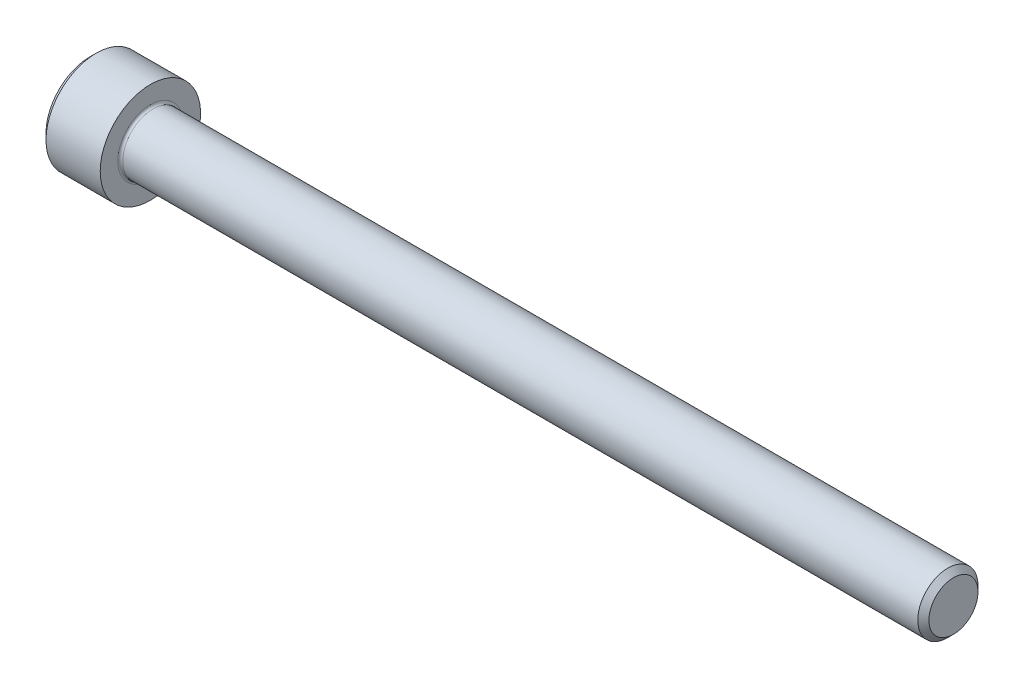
ISO-10303-21;
HEADER;
FILE_DESCRIPTION(('STEP AP214'),'2;1');
FILE_NAME('part.step','',(''),(''),'','','');
FILE_SCHEMA(('AUTOMOTIVE_DESIGN { 1 0 10303 214 1 1 1 1 }'));
ENDSEC;
DATA;
#1=APPLICATION_CONTEXT('core data for automotive mechanical design processes');
#2=APPLICATION_PROTOCOL_DEFINITION('international standard','automotive_design',2000,#1);
#3=PRODUCT_CONTEXT('',#1,'mechanical');
#4=PRODUCT('Part','Part','',(#3));
#5=PRODUCT_RELATED_PRODUCT_CATEGORY('part','',(#4));
#6=PRODUCT_DEFINITION_FORMATION('','',#4);
#7=PRODUCT_DEFINITION_CONTEXT('part definition',#1,'design');
#8=PRODUCT_DEFINITION('design','',#6,#7);
#9=PRODUCT_DEFINITION_SHAPE('','',#8);
#10=(LENGTH_UNIT() NAMED_UNIT(*) SI_UNIT(.MILLI.,.METRE.));
#11=(NAMED_UNIT(*) PLANE_ANGLE_UNIT() SI_UNIT($,.RADIAN.));
#12=(NAMED_UNIT(*) SI_UNIT($,.STERADIAN.) SOLID_ANGLE_UNIT());
#13=UNCERTAINTY_MEASURE_WITH_UNIT(LENGTH_MEASURE(1.E-05),#10,'distance_accuracy_value','');
#14=(GEOMETRIC_REPRESENTATION_CONTEXT(3) GLOBAL_UNCERTAINTY_ASSIGNED_CONTEXT((#13)) GLOBAL_UNIT_ASSIGNED_CONTEXT((#10,
#11,#12)) REPRESENTATION_CONTEXT('',''));
#15=CARTESIAN_POINT('',(0.,0.,0.));
#16=DIRECTION('',(0.,0.,1.));
#17=DIRECTION('',(1.,0.,0.));
#18=AXIS2_PLACEMENT_3D('',#15,#16,#17);
#19=CARTESIAN_POINT('',(3.,2.93524876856,0.));
#20=DIRECTION('',(1.,0.,0.));
#21=DIRECTION('',(0.,0.,-1.));
#22=AXIS2_PLACEMENT_3D('',#19,#20,#21);
#23=PLANE('',#22);
#24=DIRECTION('',(0.,1.,0.));
#25=VECTOR('',#24,1.);
#26=CARTESIAN_POINT('',(3.,2.93524876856,2.54199999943));
#27=LINE('',#26,#25);
#28=CARTESIAN_POINT('',(3.00000000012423,3.01483215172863E-10,2.541999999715));
#29=VERTEX_POINT('',#28);
#30=CARTESIAN_POINT('',(3.,-1.46762438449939,2.54199999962));
#31=VERTEX_POINT('',#30);
#32=EDGE_CURVE('E95',#29,#31,#27,.F.);
#33=ORIENTED_EDGE('',*,*,#32,.F.);
#34=CARTESIAN_POINT('',(3.00000000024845,0.,0.));
#35=DIRECTION('',(-1.,0.,0.));
#36=DIRECTION('',(0.,0.,1.));
#37=AXIS2_PLACEMENT_3D('',#34,#35,#36);
#38=CIRCLE('',#37,2.54199999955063);
#39=CARTESIAN_POINT('',(3.00000000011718,-2.20143657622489,1.27099999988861));
#40=VERTEX_POINT('',#39);
#41=EDGE_CURVE('E97',#29,#40,#38,.F.);
#42=ORIENTED_EDGE('',*,*,#41,.T.);
#43=DIRECTION('',(0.,-0.499999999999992,-0.866025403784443));
#44=VECTOR('',#43,1.);
#45=CARTESIAN_POINT('',(3.,-1.46762438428,2.542));
#46=LINE('',#45,#44);
#47=EDGE_CURVE('E100',#31,#40,#46,.T.);
#48=ORIENTED_EDGE('',*,*,#47,.F.);
#49=EDGE_LOOP('',(#33,#42,#48));
#50=FACE_BOUND('',#49,.T.);
#51=ADVANCED_FACE('F17',(#50),#23,.F.);
#52=CARTESIAN_POINT('',(3.,2.93524876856,0.));
#53=DIRECTION('',(1.,0.,0.));
#54=DIRECTION('',(0.,0.,-1.));
#55=AXIS2_PLACEMENT_3D('',#52,#53,#54);
#56=PLANE('',#55);
#57=DIRECTION('',(0.,-0.500000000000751,-0.866025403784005));
#58=VECTOR('',#57,1.);
#59=CARTESIAN_POINT('',(3.,-2.20143657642,1.271));
#60=LINE('',#59,#58);
#61=CARTESIAN_POINT('',(3.,-2.93524876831,2.61520469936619E-10));
#62=VERTEX_POINT('',#61);
#63=EDGE_CURVE('E168',#40,#62,#60,.T.);
#64=ORIENTED_EDGE('',*,*,#63,.F.);
#65=CARTESIAN_POINT('',(2.9999999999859,0.,0.));
#66=DIRECTION('',(-1.,0.,0.));
#67=DIRECTION('',(0.,0.,1.));
#68=AXIS2_PLACEMENT_3D('',#65,#66,#67);
#69=CIRCLE('',#68,2.54200000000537);
#70=CARTESIAN_POINT('',(2.9999999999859,-2.20143657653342,-1.27099999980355));
#71=VERTEX_POINT('',#70);
#72=EDGE_CURVE('E115',#40,#71,#69,.F.);
#73=ORIENTED_EDGE('',*,*,#72,.T.);
#74=DIRECTION('',(0.,0.499999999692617,-0.866025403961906));
#75=VECTOR('',#74,1.);
#76=CARTESIAN_POINT('',(3.,-2.93524876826,5.22184517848E-10));
#77=LINE('',#76,#75);
#78=EDGE_CURVE('E164',#62,#71,#77,.T.);
#79=ORIENTED_EDGE('',*,*,#78,.F.);
#80=EDGE_LOOP('',(#64,#73,#79));
#81=FACE_BOUND('',#80,.T.);
#82=ADVANCED_FACE('F223',(#81),#56,.F.);
#83=CARTESIAN_POINT('',(3.,2.93524876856,0.));
#84=DIRECTION('',(1.,0.,0.));
#85=DIRECTION('',(0.,0.,-1.));
#86=AXIS2_PLACEMENT_3D('',#83,#84,#85);
#87=PLANE('',#86);
#88=DIRECTION('',(0.,0.500000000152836,-0.866025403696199));
#89=VECTOR('',#88,1.);
#90=CARTESIAN_POINT('',(3.,-2.20143657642,-1.271));
#91=LINE('',#90,#89);
#92=CARTESIAN_POINT('',(3.,-1.46762438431,-2.54199999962));
#93=VERTEX_POINT('',#92);
#94=EDGE_CURVE('E160',#71,#93,#91,.T.);
#95=ORIENTED_EDGE('',*,*,#94,.F.);
#96=CARTESIAN_POINT('',(2.9999999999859,0.,0.));
#97=DIRECTION('',(-1.,0.,0.));
#98=DIRECTION('',(0.,0.,1.));
#99=AXIS2_PLACEMENT_3D('',#96,#97,#98);
#100=CIRCLE('',#99,2.54200000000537);
#101=CARTESIAN_POINT('',(2.9999999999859,0.,-2.54199999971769));
#102=VERTEX_POINT('',#101);
#103=EDGE_CURVE('E217',#71,#102,#100,.F.);
#104=ORIENTED_EDGE('',*,*,#103,.T.);
#105=DIRECTION('',(0.,1.,0.));
#106=VECTOR('',#105,1.);
#107=CARTESIAN_POINT('',(3.,2.93524876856,-2.54199999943));
#108=LINE('',#107,#106);
#109=EDGE_CURVE('E156',#93,#102,#108,.T.);
#110=ORIENTED_EDGE('',*,*,#109,.F.);
#111=EDGE_LOOP('',(#95,#104,#110));
#112=FACE_BOUND('',#111,.T.);
#113=ADVANCED_FACE('F226',(#112),#87,.F.);
#114=CARTESIAN_POINT('',(3.,2.93524876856,0.));
#115=DIRECTION('',(1.,0.,0.));
#116=DIRECTION('',(0.,0.,-1.));
#117=AXIS2_PLACEMENT_3D('',#114,#115,#116);
#118=PLANE('',#117);
#119=DIRECTION('',(0.,1.,0.));
#120=VECTOR('',#119,1.);
#121=CARTESIAN_POINT('',(3.,2.93524876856,-2.542));
#122=LINE('',#121,#120);
#123=CARTESIAN_POINT('',(3.,1.46762438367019,-2.54199999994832));
#124=VERTEX_POINT('',#123);
#125=EDGE_CURVE('E152',#102,#124,#122,.T.);
#126=ORIENTED_EDGE('',*,*,#125,.F.);
#127=CARTESIAN_POINT('',(2.9999999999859,0.,0.));
#128=DIRECTION('',(-1.,0.,0.));
#129=DIRECTION('',(0.,0.,1.));
#130=AXIS2_PLACEMENT_3D('',#127,#128,#129);
#131=CIRCLE('',#130,2.54200000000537);
#132=CARTESIAN_POINT('',(2.99999999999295,2.20143657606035,-1.27100000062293));
#133=VERTEX_POINT('',#132);
#134=EDGE_CURVE('E214',#102,#133,#131,.F.);
#135=ORIENTED_EDGE('',*,*,#134,.T.);
#136=DIRECTION('',(0.,0.500000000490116,0.86602540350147));
#137=VECTOR('',#136,1.);
#138=CARTESIAN_POINT('',(3.,1.46762438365,-2.54199999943));
#139=LINE('',#138,#137);
#140=EDGE_CURVE('E148',#124,#133,#139,.T.);
#141=ORIENTED_EDGE('',*,*,#140,.F.);
#142=EDGE_LOOP('',(#126,#135,#141));
#143=FACE_BOUND('',#142,.T.);
#144=ADVANCED_FACE('F234',(#143),#118,.F.);
#145=CARTESIAN_POINT('',(3.,2.93524876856,0.));
#146=DIRECTION('',(1.,0.,0.));
#147=DIRECTION('',(0.,0.,-1.));
#148=AXIS2_PLACEMENT_3D('',#145,#146,#147);
#149=PLANE('',#148);
#150=DIRECTION('',(0.,0.499999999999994,0.866025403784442));
#151=VECTOR('',#150,1.);
#152=CARTESIAN_POINT('',(3.,2.20143657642,-1.271));
#153=LINE('',#152,#151);
#154=CARTESIAN_POINT('',(3.,2.93524876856,0.));
#155=VERTEX_POINT('',#154);
#156=EDGE_CURVE('E144',#133,#155,#153,.T.);
#157=ORIENTED_EDGE('',*,*,#156,.F.);
#158=CARTESIAN_POINT('',(2.9999999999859,0.,0.));
#159=DIRECTION('',(-1.,0.,0.));
#160=DIRECTION('',(0.,0.,1.));
#161=AXIS2_PLACEMENT_3D('',#158,#159,#160);
#162=CIRCLE('',#161,2.54200000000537);
#163=CARTESIAN_POINT('',(2.99999999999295,2.20143657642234,1.27100000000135));
#164=VERTEX_POINT('',#163);
#165=EDGE_CURVE('E123',#133,#164,#162,.F.);
#166=ORIENTED_EDGE('',*,*,#165,.T.);
#167=DIRECTION('',(0.,-0.499999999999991,0.866025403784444));
#168=VECTOR('',#167,1.);
#169=CARTESIAN_POINT('',(3.,2.93524876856,0.));
#170=LINE('',#169,#168);
#171=EDGE_CURVE('E116',#155,#164,#170,.T.);
#172=ORIENTED_EDGE('',*,*,#171,.F.);
#173=EDGE_LOOP('',(#157,#166,#172));
#174=FACE_BOUND('',#173,.T.);
#175=ADVANCED_FACE('F237',(#174),#149,.F.);
#176=CARTESIAN_POINT('',(2.9999999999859,0.,0.));
#177=DIRECTION('',(-1.,0.,0.));
#178=DIRECTION('',(0.,0.,1.));
#179=AXIS2_PLACEMENT_3D('',#176,#177,#178);
#180=CONICAL_SURFACE('',#179,2.54200000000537,1.0471975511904);
#181=CARTESIAN_POINT('',(4.46762438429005,0.,0.));
#182=VERTEX_POINT('',#181);
#183=VERTEX_LOOP('',#182);
#184=FACE_BOUND('',#183,.T.);
#185=ORIENTED_EDGE('',*,*,#41,.F.);
#186=CARTESIAN_POINT('',(2.9999999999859,0.,0.));
#187=DIRECTION('',(-1.,0.,0.));
#188=DIRECTION('',(0.,0.,1.));
#189=AXIS2_PLACEMENT_3D('',#186,#187,#188);
#190=CIRCLE('',#189,2.54200000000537);
#191=EDGE_CURVE('E111',#29,#164,#190,.T.);
#192=ORIENTED_EDGE('',*,*,#191,.T.);
#193=ORIENTED_EDGE('',*,*,#165,.F.);
#194=ORIENTED_EDGE('',*,*,#134,.F.);
#195=ORIENTED_EDGE('',*,*,#103,.F.);
#196=ORIENTED_EDGE('',*,*,#72,.F.);
#197=EDGE_LOOP('',(#185,#192,#193,#194,#195,#196));
#198=FACE_BOUND('',#197,.T.);
#199=ADVANCED_FACE('F109',(#184,#198),#180,.F.);
#200=CARTESIAN_POINT('',(3.,2.93524876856,0.));
#201=DIRECTION('',(1.,0.,0.));
#202=DIRECTION('',(0.,0.,-1.));
#203=AXIS2_PLACEMENT_3D('',#200,#201,#202);
#204=PLANE('',#203);
#205=DIRECTION('',(0.,0.50000000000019,-0.866025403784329));
#206=VECTOR('',#205,1.);
#207=CARTESIAN_POINT('',(3.,2.93524876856,0.));
#208=LINE('',#207,#206);
#209=CARTESIAN_POINT('',(3.,1.46762438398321,2.54199999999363));
#210=VERTEX_POINT('',#209);
#211=EDGE_CURVE('E122',#164,#210,#208,.F.);
#212=ORIENTED_EDGE('',*,*,#211,.F.);
#213=ORIENTED_EDGE('',*,*,#191,.F.);
#214=DIRECTION('',(0.,-1.,0.));
#215=VECTOR('',#214,1.);
#216=CARTESIAN_POINT('',(3.,-1.46762438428,2.542));
#217=LINE('',#216,#215);
#218=EDGE_CURVE('E120',#29,#210,#217,.F.);
#219=ORIENTED_EDGE('',*,*,#218,.T.);
#220=EDGE_LOOP('',(#212,#213,#219));
#221=FACE_BOUND('',#220,.T.);
#222=ADVANCED_FACE('F119',(#221),#204,.F.);
#223=CARTESIAN_POINT('',(3.,2.93524876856,0.));
#224=DIRECTION('',(0.,-0.866025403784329,-0.50000000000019));
#225=DIRECTION('',(0.,0.50000000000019,-0.866025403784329));
#226=AXIS2_PLACEMENT_3D('',#223,#224,#225);
#227=PLANE('',#226);
#228=ORIENTED_EDGE('',*,*,#211,.T.);
#229=DIRECTION('',(1.,0.,0.));
#230=VECTOR('',#229,1.);
#231=CARTESIAN_POINT('',(3.,1.46762438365,2.542));
#232=LINE('',#231,#230);
#233=CARTESIAN_POINT('',(0.,1.46762438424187,2.54199999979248));
#234=VERTEX_POINT('',#233);
#235=EDGE_CURVE('E128',#210,#234,#232,.F.);
#236=ORIENTED_EDGE('',*,*,#235,.T.);
#237=DIRECTION('',(0.,-0.500000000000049,0.866025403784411));
#238=VECTOR('',#237,1.);
#239=CARTESIAN_POINT('',(0.,2.93524876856,0.));
#240=LINE('',#239,#238);
#241=CARTESIAN_POINT('',(0.,2.93524876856,0.));
#242=VERTEX_POINT('',#241);
#243=EDGE_CURVE('E135',#242,#234,#240,.T.);
#244=ORIENTED_EDGE('',*,*,#243,.F.);
#245=DIRECTION('',(1.,0.,0.));
#246=VECTOR('',#245,1.);
#247=CARTESIAN_POINT('',(3.,2.93524876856,0.));
#248=LINE('',#247,#246);
#249=EDGE_CURVE('E179',#242,#155,#248,.T.);
#250=ORIENTED_EDGE('',*,*,#249,.T.);
#251=ORIENTED_EDGE('',*,*,#171,.T.);
#252=EDGE_LOOP('',(#228,#236,#244,#250,#251));
#253=FACE_BOUND('',#252,.T.);
#254=ADVANCED_FACE('F245',(#253),#227,.T.);
#255=CARTESIAN_POINT('',(3.,-1.46762438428,2.542));
#256=DIRECTION('',(0.,0.,1.));
#257=DIRECTION('',(0.,-1.,0.));
#258=AXIS2_PLACEMENT_3D('',#255,#256,#257);
#259=PLANE('',#258);
#260=ORIENTED_EDGE('',*,*,#235,.F.);
#261=ORIENTED_EDGE('',*,*,#218,.F.);
#262=ORIENTED_EDGE('',*,*,#32,.T.);
#263=DIRECTION('',(1.,0.,0.));
#264=VECTOR('',#263,1.);
#265=CARTESIAN_POINT('',(3.,-1.46762438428,2.542));
#266=LINE('',#265,#264);
#267=CARTESIAN_POINT('',(0.,-1.46762438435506,2.54199999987));
#268=VERTEX_POINT('',#267);
#269=EDGE_CURVE('E130',#268,#31,#266,.T.);
#270=ORIENTED_EDGE('',*,*,#269,.F.);
#271=DIRECTION('',(0.,1.,0.));
#272=VECTOR('',#271,1.);
#273=CARTESIAN_POINT('',(0.,0.,2.54199999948));
#274=LINE('',#273,#272);
#275=EDGE_CURVE('E249',#234,#268,#274,.F.);
#276=ORIENTED_EDGE('',*,*,#275,.F.);
#277=EDGE_LOOP('',(#260,#261,#262,#270,#276));
#278=FACE_BOUND('',#277,.T.);
#279=ADVANCED_FACE('F126',(#278),#259,.F.);
#280=CARTESIAN_POINT('',(3.,-1.46762438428,2.542));
#281=DIRECTION('',(0.,0.866025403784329,-0.50000000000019));
#282=DIRECTION('',(0.,0.50000000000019,0.866025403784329));
#283=AXIS2_PLACEMENT_3D('',#280,#281,#282);
#284=PLANE('',#283);
#285=ORIENTED_EDGE('',*,*,#63,.T.);
#286=DIRECTION('',(1.,0.,0.));
#287=VECTOR('',#286,1.);
#288=CARTESIAN_POINT('',(3.,-2.93524876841,-2.59807231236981E-10));
#289=LINE('',#288,#287);
#290=CARTESIAN_POINT('',(0.,-2.93524876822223,1.95986455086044E-10));
#291=VERTEX_POINT('',#290);
#292=EDGE_CURVE('E190',#291,#62,#289,.T.);
#293=ORIENTED_EDGE('',*,*,#292,.F.);
#294=DIRECTION('',(0.,-0.499999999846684,-0.866025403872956));
#295=VECTOR('',#294,1.);
#296=CARTESIAN_POINT('',(0.,-1.46762438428,2.542));
#297=LINE('',#296,#295);
#298=EDGE_CURVE('E250',#268,#291,#297,.T.);
#299=ORIENTED_EDGE('',*,*,#298,.F.);
#300=ORIENTED_EDGE('',*,*,#269,.T.);
#301=ORIENTED_EDGE('',*,*,#47,.T.);
#302=EDGE_LOOP('',(#285,#293,#299,#300,#301));
#303=FACE_BOUND('',#302,.T.);
#304=ADVANCED_FACE('F333',(#303),#284,.T.);
#305=CARTESIAN_POINT('',(3.,-2.93524876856,0.));
#306=DIRECTION('',(0.,0.866025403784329,0.50000000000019));
#307=DIRECTION('',(0.,-0.50000000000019,0.866025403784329));
#308=AXIS2_PLACEMENT_3D('',#305,#306,#307);
#309=PLANE('',#308);
#310=ORIENTED_EDGE('',*,*,#94,.T.);
#311=DIRECTION('',(1.,0.,0.));
#312=VECTOR('',#311,1.);
#313=CARTESIAN_POINT('',(3.,-1.46762438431,-2.542));
#314=LINE('',#313,#312);
#315=CARTESIAN_POINT('',(0.,-1.46762438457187,-2.54199999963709));
#316=VERTEX_POINT('',#315);
#317=EDGE_CURVE('E183',#93,#316,#314,.F.);
#318=ORIENTED_EDGE('',*,*,#317,.T.);
#319=DIRECTION('',(0.,0.499999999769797,-0.866025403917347));
#320=VECTOR('',#319,1.);
#321=CARTESIAN_POINT('',(0.,-2.93524876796,0.));
#322=LINE('',#321,#320);
#323=EDGE_CURVE('E252',#291,#316,#322,.T.);
#324=ORIENTED_EDGE('',*,*,#323,.F.);
#325=ORIENTED_EDGE('',*,*,#292,.T.);
#326=ORIENTED_EDGE('',*,*,#78,.T.);
#327=EDGE_LOOP('',(#310,#318,#324,#325,#326));
#328=FACE_BOUND('',#327,.T.);
#329=ADVANCED_FACE('F329',(#328),#309,.T.);
#330=CARTESIAN_POINT('',(3.,1.46762438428,-2.542));
#331=DIRECTION('',(0.,0.,-1.));
#332=DIRECTION('',(0.,1.,0.));
#333=AXIS2_PLACEMENT_3D('',#330,#331,#332);
#334=PLANE('',#333);
#335=ORIENTED_EDGE('',*,*,#317,.F.);
#336=ORIENTED_EDGE('',*,*,#109,.T.);
#337=ORIENTED_EDGE('',*,*,#125,.T.);
#338=DIRECTION('',(1.,0.,0.));
#339=VECTOR('',#338,1.);
#340=CARTESIAN_POINT('',(3.,1.46762438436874,-2.54199999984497));
#341=LINE('',#340,#339);
#342=CARTESIAN_POINT('',(0.,1.46762438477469,-2.54199999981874));
#343=VERTEX_POINT('',#342);
#344=EDGE_CURVE('E182',#124,#343,#341,.F.);
#345=ORIENTED_EDGE('',*,*,#344,.T.);
#346=DIRECTION('',(0.,1.,0.));
#347=VECTOR('',#346,1.);
#348=CARTESIAN_POINT('',(0.,0.,-2.54199999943));
#349=LINE('',#348,#347);
#350=EDGE_CURVE('E257',#316,#343,#349,.T.);
#351=ORIENTED_EDGE('',*,*,#350,.F.);
#352=EDGE_LOOP('',(#335,#336,#337,#345,#351));
#353=FACE_BOUND('',#352,.T.);
#354=ADVANCED_FACE('F326',(#353),#334,.F.);
#355=CARTESIAN_POINT('',(3.,2.93524876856,0.));
#356=DIRECTION('',(0.,0.866025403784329,-0.50000000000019));
#357=DIRECTION('',(0.,0.50000000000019,0.866025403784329));
#358=AXIS2_PLACEMENT_3D('',#355,#356,#357);
#359=PLANE('',#358);
#360=ORIENTED_EDGE('',*,*,#344,.F.);
#361=ORIENTED_EDGE('',*,*,#140,.T.);
#362=ORIENTED_EDGE('',*,*,#156,.T.);
#363=ORIENTED_EDGE('',*,*,#249,.F.);
#364=DIRECTION('',(0.,0.499999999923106,0.866025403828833));
#365=VECTOR('',#364,1.);
#366=CARTESIAN_POINT('',(0.,1.46762438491,-2.54199999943));
#367=LINE('',#366,#365);
#368=EDGE_CURVE('E210',#343,#242,#367,.T.);
#369=ORIENTED_EDGE('',*,*,#368,.F.);
#370=EDGE_LOOP('',(#360,#361,#362,#363,#369));
#371=FACE_BOUND('',#370,.T.);
#372=ADVANCED_FACE('F241',(#371),#359,.F.);
#373=CARTESIAN_POINT('',(0.,0.,0.));
#374=DIRECTION('',(-1.,0.,0.));
#375=DIRECTION('',(0.,0.,1.));
#376=AXIS2_PLACEMENT_3D('',#373,#374,#375);
#377=PLANE('',#376);
#378=ORIENTED_EDGE('',*,*,#350,.T.);
#379=ORIENTED_EDGE('',*,*,#368,.T.);
#380=ORIENTED_EDGE('',*,*,#243,.T.);
#381=ORIENTED_EDGE('',*,*,#275,.T.);
#382=ORIENTED_EDGE('',*,*,#298,.T.);
#383=ORIENTED_EDGE('',*,*,#323,.T.);
#384=EDGE_LOOP('',(#378,#379,#380,#381,#382,#383));
#385=FACE_BOUND('',#384,.T.);
#386=CARTESIAN_POINT('',(0.,0.,0.));
#387=DIRECTION('',(1.,0.,0.));
#388=DIRECTION('',(0.,0.,-1.));
#389=AXIS2_PLACEMENT_3D('',#386,#387,#388);
#390=CIRCLE('',#389,4.39999999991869);
#391=CARTESIAN_POINT('',(0.,0.,-4.39999999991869));
#392=VERTEX_POINT('',#391);
#393=EDGE_CURVE('E208',#392,#392,#390,.T.);
#394=ORIENTED_EDGE('',*,*,#393,.F.);
#395=EDGE_LOOP('',(#394));
#396=FACE_BOUND('',#395,.T.);
#397=ADVANCED_FACE('F320',(#385,#396),#377,.T.);
#398=CARTESIAN_POINT('',(0.600000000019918,0.,0.));
#399=DIRECTION('',(1.,0.,0.));
#400=DIRECTION('',(0.,0.,-1.));
#401=AXIS2_PLACEMENT_3D('',#398,#399,#400);
#402=CONICAL_SURFACE('',#401,4.99999999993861,0.785398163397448);
#403=ORIENTED_EDGE('',*,*,#393,.T.);
#404=EDGE_LOOP('',(#403));
#405=FACE_BOUND('',#404,.T.);
#406=CARTESIAN_POINT('',(0.600000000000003,0.,0.));
#407=DIRECTION('',(-1.,0.,0.));
#408=DIRECTION('',(0.,0.,1.));
#409=AXIS2_PLACEMENT_3D('',#406,#407,#408);
#410=CIRCLE('',#409,5.);
#411=CARTESIAN_POINT('',(0.600000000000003,0.,5.));
#412=VERTEX_POINT('',#411);
#413=EDGE_CURVE('E207',#412,#412,#410,.F.);
#414=ORIENTED_EDGE('',*,*,#413,.F.);
#415=EDGE_LOOP('',(#414));
#416=FACE_BOUND('',#415,.T.);
#417=ADVANCED_FACE('F316',(#405,#416),#402,.T.);
#418=CARTESIAN_POINT('',(-31.75,0.,0.));
#419=DIRECTION('',(-1.,0.,0.));
#420=DIRECTION('',(0.,0.,1.));
#421=AXIS2_PLACEMENT_3D('',#418,#419,#420);
#422=CYLINDRICAL_SURFACE('',#421,5.);
#423=CARTESIAN_POINT('',(6.,0.,0.));
#424=DIRECTION('',(-1.,0.,0.));
#425=DIRECTION('',(0.,0.,1.));
#426=AXIS2_PLACEMENT_3D('',#423,#424,#425);
#427=CIRCLE('',#426,5.);
#428=CARTESIAN_POINT('',(6.,0.,5.));
#429=VERTEX_POINT('',#428);
#430=EDGE_CURVE('E204',#429,#429,#427,.F.);
#431=ORIENTED_EDGE('',*,*,#430,.F.);
#432=EDGE_LOOP('',(#431));
#433=FACE_BOUND('',#432,.T.);
#434=ORIENTED_EDGE('',*,*,#413,.T.);
#435=EDGE_LOOP('',(#434));
#436=FACE_BOUND('',#435,.T.);
#437=ADVANCED_FACE('F312',(#433,#436),#422,.T.);
#438=CARTESIAN_POINT('',(86.,2.4455,0.));
#439=DIRECTION('',(1.,0.,0.));
#440=DIRECTION('',(0.,0.,-1.));
#441=AXIS2_PLACEMENT_3D('',#438,#439,#440);
#442=PLANE('',#441);
#443=CARTESIAN_POINT('',(86.0000000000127,0.,0.));
#444=DIRECTION('',(-1.,0.,0.));
#445=DIRECTION('',(0.,0.,1.));
#446=AXIS2_PLACEMENT_3D('',#443,#444,#445);
#447=CIRCLE('',#446,2.4454999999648);
#448=CARTESIAN_POINT('',(86.0000000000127,0.,2.4454999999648));
#449=VERTEX_POINT('',#448);
#450=EDGE_CURVE('E200',#449,#449,#447,.T.);
#451=ORIENTED_EDGE('',*,*,#450,.F.);
#452=EDGE_LOOP('',(#451));
#453=FACE_BOUND('',#452,.T.);
#454=ADVANCED_FACE('F301',(#453),#442,.T.);
#455=CARTESIAN_POINT('',(6.,5.,0.));
#456=DIRECTION('',(1.,0.,0.));
#457=DIRECTION('',(0.,0.,-1.));
#458=AXIS2_PLACEMENT_3D('',#455,#456,#457);
#459=PLANE('',#458);
#460=CARTESIAN_POINT('',(6.,0.,0.));
#461=DIRECTION('',(1.,0.,0.));
#462=DIRECTION('',(0.,0.,1.));
#463=AXIS2_PLACEMENT_3D('',#460,#461,#462);
#464=CIRCLE('',#463,3.25);
#465=CARTESIAN_POINT('',(6.,0.,-3.25));
#466=VERTEX_POINT('',#465);
#467=CARTESIAN_POINT('',(6.,0.,3.25));
#468=VERTEX_POINT('',#467);
#469=EDGE_CURVE('E203',#466,#468,#464,.F.);
#470=ORIENTED_EDGE('',*,*,#469,.T.);
#471=CARTESIAN_POINT('',(6.,0.,-3.25));
#472=CARTESIAN_POINT('',(6.00000000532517,0.0425763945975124,-3.24998718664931));
#473=CARTESIAN_POINT('',(6.00000000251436,0.0851521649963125,-3.24914609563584));
#474=CARTESIAN_POINT('',(5.99999999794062,0.17023607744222,-3.24581345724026));
#475=CARTESIAN_POINT('',(5.99999999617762,0.212744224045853,-3.24332202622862));
#476=CARTESIAN_POINT('',(6.00000001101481,0.297630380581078,-3.23669497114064));
#477=CARTESIAN_POINT('',(6.00000002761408,0.340008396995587,-3.23255943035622));
#478=CARTESIAN_POINT('',(6.00000007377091,0.424568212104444,-3.22263708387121));
#479=CARTESIAN_POINT('',(6.00000010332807,0.466750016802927,-3.21685032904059));
#480=CARTESIAN_POINT('',(6.0000003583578,0.550866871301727,-3.2036862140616));
#481=CARTESIAN_POINT('',(6.00000058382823,0.592801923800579,-3.19630887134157));
#482=CARTESIAN_POINT('',(6.00000074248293,0.660206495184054,-3.18296934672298));
#483=CARTESIAN_POINT('',(6.00000075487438,0.685786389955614,-3.17755934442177));
#484=CARTESIAN_POINT('',(6.00000070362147,0.757853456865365,-3.16137245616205));
#485=CARTESIAN_POINT('',(6.00000056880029,0.804175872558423,-3.14985056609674));
#486=CARTESIAN_POINT('',(6.00000037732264,0.881045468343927,-3.12891688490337));
#487=CARTESIAN_POINT('',(6.00000030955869,0.911747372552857,-3.12006594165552));
#488=CARTESIAN_POINT('',(6.00000019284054,0.971970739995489,-3.10173621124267));
#489=CARTESIAN_POINT('',(6.00000014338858,1.0015002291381,-3.09228379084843));
#490=CARTESIAN_POINT('',(6.00000004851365,1.07595008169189,-3.06727588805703));
#491=CARTESIAN_POINT('',(6.00000001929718,1.12068186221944,-3.05115352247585));
#492=CARTESIAN_POINT('',(6.00000000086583,1.19139695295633,-3.02392060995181));
#493=CARTESIAN_POINT('',(6.00000000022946,1.21762221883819,-3.01343120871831));
#494=CARTESIAN_POINT('',(5.99999999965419,1.28303073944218,-2.98630750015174));
#495=CARTESIAN_POINT('',(6.00000000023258,1.32204164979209,-2.96925430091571));
#496=CARTESIAN_POINT('',(5.99999999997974,1.39936413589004,-2.93363820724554));
#497=CARTESIAN_POINT('',(5.9999999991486,1.43767575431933,-2.91507540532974));
#498=CARTESIAN_POINT('',(6.00000002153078,1.51355069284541,-2.87648154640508));
#499=CARTESIAN_POINT('',(6.00000004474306,1.55111404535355,-2.85645055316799));
#500=CARTESIAN_POINT('',(6.00000010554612,1.62542686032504,-2.81493620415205));
#501=CARTESIAN_POINT('',(6.00000014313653,1.66217634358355,-2.79345288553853));
#502=CARTESIAN_POINT('',(6.00000041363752,1.73483768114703,-2.74910938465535));
#503=CARTESIAN_POINT('',(6.0000006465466,1.77074954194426,-2.72624921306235));
#504=CARTESIAN_POINT('',(6.00000080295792,1.82795861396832,-2.68810209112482));
#505=CARTESIAN_POINT('',(6.00000081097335,1.84956797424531,-2.67328132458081));
#506=CARTESIAN_POINT('',(6.00000074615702,1.90998925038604,-2.63071737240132));
#507=CARTESIAN_POINT('',(6.00000060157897,1.94836508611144,-2.60235080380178));
#508=CARTESIAN_POINT('',(6.00000039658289,2.01133484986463,-2.55361779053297));
#509=CARTESIAN_POINT('',(6.00000032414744,2.0362866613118,-2.53371064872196));
#510=CARTESIAN_POINT('',(6.00000020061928,2.08465109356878,-2.49394203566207));
#511=CARTESIAN_POINT('',(6.00000014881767,2.10808611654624,-2.47410780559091));
#512=CARTESIAN_POINT('',(6.00000004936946,2.16697759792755,-2.42282018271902));
#513=CARTESIAN_POINT('',(6.0000000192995,2.20204149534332,-2.39091337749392));
#514=CARTESIAN_POINT('',(6.0000000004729,2.25722218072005,-2.33847965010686));
#515=CARTESIAN_POINT('',(6.00000000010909,2.27778663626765,-2.31842030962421));
#516=CARTESIAN_POINT('',(5.99999999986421,2.3281776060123,-2.26798939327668));
#517=CARTESIAN_POINT('',(6.00000000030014,2.35769325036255,-2.23730550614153));
#518=CARTESIAN_POINT('',(5.99999999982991,2.4155006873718,-2.17481052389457));
#519=CARTESIAN_POINT('',(5.99999999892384,2.44379255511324,-2.14299949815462));
#520=CARTESIAN_POINT('',(6.00000002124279,2.49912306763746,-2.0783073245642));
#521=CARTESIAN_POINT('',(6.00000004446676,2.52616176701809,-2.04542622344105));
#522=CARTESIAN_POINT('',(6.00000010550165,2.57893142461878,-1.9786336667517));
#523=CARTESIAN_POINT('',(6.00000014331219,2.60466241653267,-1.94472223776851));
#524=CARTESIAN_POINT('',(6.00000041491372,2.65482362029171,-1.87594786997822));
#525=CARTESIAN_POINT('',(6.00000064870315,2.67925384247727,-1.8410849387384));
#526=CARTESIAN_POINT('',(6.00000080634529,2.71752290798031,-1.78392958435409));
#527=CARTESIAN_POINT('',(6.00000081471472,2.73182804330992,-1.76194807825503));
#528=CARTESIAN_POINT('',(6.00000075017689,2.7713680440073,-1.69948869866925));
#529=CARTESIAN_POINT('',(6.00000060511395,2.79596216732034,-1.65860224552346));
#530=CARTESIAN_POINT('',(6.00000039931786,2.83547615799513,-1.58950167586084));
#531=CARTESIAN_POINT('',(6.00000032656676,2.85090253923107,-1.56157499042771));
#532=CARTESIAN_POINT('',(6.00000020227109,2.88038482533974,-1.5062908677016));
#533=CARTESIAN_POINT('',(6.00000015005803,2.89447006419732,-1.47894907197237));
#534=CARTESIAN_POINT('',(6.00000004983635,2.92928428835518,-1.40895374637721));
#535=CARTESIAN_POINT('',(6.00000001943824,2.94947738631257,-1.36603173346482));
#536=CARTESIAN_POINT('',(6.00000000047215,2.9803631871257,-1.29652211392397));
#537=CARTESIAN_POINT('',(6.00000000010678,2.99165160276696,-1.27019651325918));
#538=CARTESIAN_POINT('',(5.99999999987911,3.01887545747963,-1.2043969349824));
#539=CARTESIAN_POINT('',(6.00000000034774,3.03440220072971,-1.16475256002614));
#540=CARTESIAN_POINT('',(5.99999999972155,3.06389369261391,-1.08489082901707));
#541=CARTESIAN_POINT('',(5.99999999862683,3.07785853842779,-1.04467350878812));
#542=CARTESIAN_POINT('',(6.0000000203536,3.10422096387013,-0.963729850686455));
#543=CARTESIAN_POINT('',(6.00000004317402,3.11661861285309,-0.923003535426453));
#544=CARTESIAN_POINT('',(6.00000010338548,3.13981148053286,-0.841099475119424));
#545=CARTESIAN_POINT('',(6.00000014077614,3.15060674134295,-0.799921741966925));
#546=CARTESIAN_POINT('',(6.00000041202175,3.17063151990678,-0.717185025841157));
#547=CARTESIAN_POINT('',(6.00000064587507,3.17986105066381,-0.675626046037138));
#548=CARTESIAN_POINT('',(6.00000080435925,3.1933442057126,-0.608180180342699));
#549=CARTESIAN_POINT('',(6.00000081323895,3.1981477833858,-0.58240213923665));
#550=CARTESIAN_POINT('',(6.00000075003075,3.21077584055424,-0.509569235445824));
#551=CARTESIAN_POINT('',(6.00000060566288,3.21785180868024,-0.462382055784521));
#552=CARTESIAN_POINT('',(6.00000040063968,3.22791536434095,-0.383415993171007));
#553=CARTESIAN_POINT('',(6.00000032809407,3.23148088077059,-0.351708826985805));
#554=CARTESIAN_POINT('',(6.00000020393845,3.2375653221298,-0.289325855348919));
#555=CARTESIAN_POINT('',(6.00000015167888,3.24011679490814,-0.258653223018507));
#556=CARTESIAN_POINT('',(6.00000005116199,3.24549564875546,-0.180630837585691));
#557=CARTESIAN_POINT('',(6.00000002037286,3.24772521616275,-0.133238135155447));
#558=CARTESIAN_POINT('',(6.0000000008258,3.24965765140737,-0.0572242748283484));
#559=CARTESIAN_POINT('',(6.00000000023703,3.25001209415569,-0.028617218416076));
#560=CARTESIAN_POINT('',(5.99999999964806,3.24998156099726,0.0424882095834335));
#561=CARTESIAN_POINT('',(6.00000000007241,3.24915403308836,0.0849876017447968));
#562=CARTESIAN_POINT('',(6.00000000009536,3.2458328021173,0.16991948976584));
#563=CARTESIAN_POINT('',(5.99999999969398,3.24333913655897,0.212351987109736));
#564=CARTESIAN_POINT('',(6.00000000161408,3.23670266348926,0.29708735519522));
#565=CARTESIAN_POINT('',(6.00000000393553,3.23255987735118,0.339390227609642));
#566=CARTESIAN_POINT('',(6.00000001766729,3.22262781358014,0.423802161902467));
#567=CARTESIAN_POINT('',(6.00000002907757,3.21683854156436,0.465911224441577));
#568=CARTESIAN_POINT('',(6.00000007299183,3.20362391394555,0.549871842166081));
#569=CARTESIAN_POINT('',(6.00000010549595,3.19619854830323,0.591723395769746));
#570=CARTESIAN_POINT('',(6.00000020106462,3.17972020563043,0.675106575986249));
#571=CARTESIAN_POINT('',(6.00000026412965,3.17066720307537,0.716638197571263));
#572=CARTESIAN_POINT('',(6.00000041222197,3.15558247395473,0.779912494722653));
#573=CARTESIAN_POINT('',(6.00000047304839,3.15012701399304,0.801794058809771));
#574=CARTESIAN_POINT('',(6.00000058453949,3.1393955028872,0.842980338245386));
#575=CARTESIAN_POINT('',(6.00000063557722,3.13416840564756,0.862297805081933));
#576=CARTESIAN_POINT('',(6.00000073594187,3.11722263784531,0.922594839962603));
#577=CARTESIAN_POINT('',(6.0000007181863,3.10484202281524,0.963390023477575));
#578=CARTESIAN_POINT('',(6.00000052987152,3.07845495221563,1.04443538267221));
#579=CARTESIAN_POINT('',(6.00000035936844,3.06444909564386,1.08468575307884));
#580=CARTESIAN_POINT('',(6.00000011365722,3.03774347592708,1.1563777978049));
#581=CARTESIAN_POINT('',(6.00000002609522,3.02536174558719,1.18793860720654));
#582=CARTESIAN_POINT('',(5.99999998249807,3.00394912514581,1.24062569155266));
#583=CARTESIAN_POINT('',(5.99999999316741,2.99512444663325,1.26183655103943));
#584=CARTESIAN_POINT('',(6.00000001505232,2.96859722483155,1.32374030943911));
#585=CARTESIAN_POINT('',(6.00000001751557,2.95028340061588,1.36417266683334));
#586=CARTESIAN_POINT('',(6.00000009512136,2.900031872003,1.46937358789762));
#587=CARTESIAN_POINT('',(6.00000021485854,2.86675076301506,1.53350843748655));
#588=CARTESIAN_POINT('',(6.0000004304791,2.81359206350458,1.62804969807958));
#589=CARTESIAN_POINT('',(6.00000050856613,2.79528928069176,1.65935341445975));
#590=CARTESIAN_POINT('',(6.00000062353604,2.75544976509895,1.72489642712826));
#591=CARTESIAN_POINT('',(6.0000006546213,2.73378362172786,1.75905741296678));
#592=CARTESIAN_POINT('',(6.00000066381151,2.68813763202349,1.82810046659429));
#593=CARTESIAN_POINT('',(6.00000063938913,2.66409706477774,1.86294235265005));
#594=CARTESIAN_POINT('',(6.00000054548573,2.61356034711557,1.93317248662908));
#595=CARTESIAN_POINT('',(6.00000047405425,2.58700257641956,1.96851642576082));
#596=CARTESIAN_POINT('',(6.00000030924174,2.53247045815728,2.03804096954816));
#597=CARTESIAN_POINT('',(6.00000021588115,2.50449744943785,2.07222262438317));
#598=CARTESIAN_POINT('',(6.00000009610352,2.45051494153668,2.13552493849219));
#599=CARTESIAN_POINT('',(6.00000006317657,2.42465415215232,2.1647726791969));
#600=CARTESIAN_POINT('',(6.00000002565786,2.37107679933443,2.22326121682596));
#601=CARTESIAN_POINT('',(6.00000002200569,2.34332733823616,2.25247189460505));
#602=CARTESIAN_POINT('',(6.00000002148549,2.28486478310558,2.31179750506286));
#603=CARTESIAN_POINT('',(6.00000002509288,2.25407817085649,2.34184002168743));
#604=CARTESIAN_POINT('',(6.00000004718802,2.18936309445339,2.40256016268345));
#605=CARTESIAN_POINT('',(6.00000006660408,2.15535915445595,2.43315742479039));
#606=CARTESIAN_POINT('',(6.0000001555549,2.08941207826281,2.49005958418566));
#607=CARTESIAN_POINT('',(6.00000022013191,2.05758179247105,2.51649551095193));
#608=CARTESIAN_POINT('',(6.00000039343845,1.98679960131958,2.5730256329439));
#609=CARTESIAN_POINT('',(6.00000050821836,1.94764180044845,2.60286295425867));
#610=CARTESIAN_POINT('',(6.00000065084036,1.87337685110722,2.65678123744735));
#611=CARTESIAN_POINT('',(6.00000068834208,1.8384382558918,2.68109490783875));
#612=CARTESIAN_POINT('',(6.00000070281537,1.76801423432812,2.72804875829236));
#613=CARTESIAN_POINT('',(6.00000068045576,1.73253921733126,2.75070454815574));
#614=CARTESIAN_POINT('',(6.00000056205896,1.65608539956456,2.79742527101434));
#615=CARTESIAN_POINT('',(6.0000004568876,1.61498704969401,2.82129484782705));
#616=CARTESIAN_POINT('',(6.00000026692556,1.53093339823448,2.86766341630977));
#617=CARTESIAN_POINT('',(6.00000018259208,1.48795733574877,2.89012473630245));
#618=CARTESIAN_POINT('',(6.000000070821,1.40051501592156,2.93338559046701));
#619=CARTESIAN_POINT('',(6.00000004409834,1.35603691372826,2.95416119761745));
#620=CARTESIAN_POINT('',(6.00000001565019,1.27356782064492,2.99045190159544));
#621=CARTESIAN_POINT('',(6.00000001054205,1.23571014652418,3.00627076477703));
#622=CARTESIAN_POINT('',(6.00000000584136,1.16691980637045,3.03352162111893));
#623=CARTESIAN_POINT('',(6.00000000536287,1.1360867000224,3.04520516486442));
#624=CARTESIAN_POINT('',(6.00000001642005,1.09412505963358,3.06041100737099));
#625=CARTESIAN_POINT('',(6.000000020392,1.08313848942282,3.06432837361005));
#626=CARTESIAN_POINT('',(6.00000003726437,1.04921840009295,3.07622035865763));
#627=CARTESIAN_POINT('',(6.00000005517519,1.02621634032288,3.08400033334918));
#628=CARTESIAN_POINT('',(6.00000010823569,0.962725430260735,3.10467547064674));
#629=CARTESIAN_POINT('',(6.00000014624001,0.922059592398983,3.11703100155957));
#630=CARTESIAN_POINT('',(6.00000021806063,0.84027208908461,3.1401276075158));
#631=CARTESIAN_POINT('',(6.00000025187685,0.799150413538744,3.15086864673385));
#632=CARTESIAN_POINT('',(6.00000030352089,0.716513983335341,3.17071740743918));
#633=CARTESIAN_POINT('',(6.00000032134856,0.674999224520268,3.17982511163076));
#634=CARTESIAN_POINT('',(6.0000003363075,0.591642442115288,3.19639336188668));
#635=CARTESIAN_POINT('',(6.00000033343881,0.549800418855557,3.20385390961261));
#636=CARTESIAN_POINT('',(6.00000030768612,0.465854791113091,3.21711597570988));
#637=CARTESIAN_POINT('',(6.00000028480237,0.423751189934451,3.22291751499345));
#638=CARTESIAN_POINT('',(6.0000002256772,0.339348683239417,3.23285256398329));
#639=CARTESIAN_POINT('',(6.0000001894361,0.297049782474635,3.23698611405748));
#640=CARTESIAN_POINT('',(6.00000011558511,0.212323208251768,3.24357861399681));
#641=CARTESIAN_POINT('',(6.00000007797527,0.169895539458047,3.24603762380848));
#642=CARTESIAN_POINT('',(6.00000002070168,0.0849782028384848,3.24927785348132));
#643=CARTESIAN_POINT('',(6.00000000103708,0.0424885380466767,3.25005915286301));
#644=CARTESIAN_POINT('',(6.,0.,3.25));
#645=B_SPLINE_CURVE_WITH_KNOTS('',3,(#471,#472,#473,#474,#475,#476,#477,#478,#479,#480,#481,
#482,#483,#484,#485,#486,#487,#488,#489,#490,#491,#492,#493,#494,#495,#496,#497,#498,#499,#500,
#501,#502,#503,#504,#505,#506,#507,#508,#509,#510,#511,#512,#513,#514,#515,#516,#517,#518,#519,
#520,#521,#522,#523,#524,#525,#526,#527,#528,#529,#530,#531,#532,#533,#534,#535,#536,#537,#538,
#539,#540,#541,#542,#543,#544,#545,#546,#547,#548,#549,#550,#551,#552,#553,#554,#555,#556,#557,
#558,#559,#560,#561,#562,#563,#564,#565,#566,#567,#568,#569,#570,#571,#572,#573,#574,#575,#576,
#577,#578,#579,#580,#581,#582,#583,#584,#585,#586,#587,#588,#589,#590,#591,#592,#593,#594,#595,
#596,#597,#598,#599,#600,#601,#602,#603,#604,#605,#606,#607,#608,#609,#610,#611,#612,#613,#614,
#615,#616,#617,#618,#619,#620,#621,#622,#623,#624,#625,#626,#627,#628,#629,#630,#631,#632,#633,
#634,#635,#636,#637,#638,#639,#640,#641,#642,#643,#644),.UNSPECIFIED.,.F.,.F.,(4,2,2,2,2,2,2,2,
2,2,2,2,2,2,2,2,2,2,2,2,2,2,2,2,2,2,2,2,2,2,2,2,2,2,2,2,2,2,2,2,2,2,2,2,2,2,2,2,2,2,2,2,2,2,2,2,
2,2,2,2,2,2,2,2,2,2,2,2,2,2,2,2,2,2,2,2,2,2,2,2,2,2,2,2,2,2,4),(0.,0.127720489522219,
0.255431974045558,0.383136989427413,0.510838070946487,0.638537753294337,0.716968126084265,
0.860114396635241,0.955958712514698,1.04896372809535,1.19155726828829,1.2762861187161,
1.40397787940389,1.53166182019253,1.65934021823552,1.78701535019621,1.91468949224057,
1.99329291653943,2.1364030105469,2.23215064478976,2.32424484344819,2.4664174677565,
2.55259298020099,2.68028521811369,2.8079696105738,2.93564843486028,3.06332396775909,
3.19099848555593,3.26967077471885,3.41275592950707,3.50845591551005,3.60071458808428,
3.74296742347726,3.82889158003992,3.95658669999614,4.08427387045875,4.21195538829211,
4.33963354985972,4.46731065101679,4.54596911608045,4.6890582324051,4.78476688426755,
4.87709146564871,5.01937525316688,5.10519586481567,5.23268384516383,5.36016895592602,
5.48765241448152,5.61513543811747,5.74261924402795,5.8701050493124,5.93775488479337,
5.99778819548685,6.12564846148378,6.25346175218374,6.35515455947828,6.42407162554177,
6.55719719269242,6.77377927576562,6.88254834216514,7.00387442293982,7.13083462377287,
7.26342594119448,7.3958940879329,7.51299381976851,7.63383745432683,7.76285241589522,
7.90004165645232,8.02414379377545,8.17177878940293,8.29944372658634,8.42568823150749,
8.56822171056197,8.71364937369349,8.86087163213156,8.98393273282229,9.08283472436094,
9.11782653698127,9.19066711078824,9.31813574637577,9.44560721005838,9.57308002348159,
9.70055270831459,9.8280237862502,9.95549177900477,10.0829552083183,10.2104125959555),.UNSPECIFIED.);
#646=EDGE_CURVE('E36',#468,#466,#645,.F.);
#647=ORIENTED_EDGE('',*,*,#646,.T.);
#648=EDGE_LOOP('',(#470,#647));
#649=FACE_BOUND('',#648,.T.);
#650=ORIENTED_EDGE('',*,*,#430,.T.);
#651=EDGE_LOOP('',(#650));
#652=FACE_BOUND('',#651,.T.);
#653=ADVANCED_FACE('F292',(#649,#652),#459,.T.);
#654=CARTESIAN_POINT('',(85.4454999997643,0.,0.));
#655=DIRECTION('',(-1.,0.,0.));
#656=DIRECTION('',(0.,0.,1.));
#657=AXIS2_PLACEMENT_3D('',#654,#655,#656);
#658=CONICAL_SURFACE('',#657,3.00000000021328,0.785398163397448);
#659=ORIENTED_EDGE('',*,*,#450,.T.);
#660=EDGE_LOOP('',(#659));
#661=FACE_BOUND('',#660,.T.);
#662=CARTESIAN_POINT('',(85.4454999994,0.,0.));
#663=DIRECTION('',(-1.,0.,0.));
#664=DIRECTION('',(0.,0.,1.));
#665=AXIS2_PLACEMENT_3D('',#662,#663,#664);
#666=CIRCLE('',#665,3.);
#667=CARTESIAN_POINT('',(85.4454999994,0.,3.));
#668=VERTEX_POINT('',#667);
#669=EDGE_CURVE('E28',#668,#668,#666,.T.);
#670=ORIENTED_EDGE('',*,*,#669,.F.);
#671=EDGE_LOOP('',(#670));
#672=FACE_BOUND('',#671,.T.);
#673=ADVANCED_FACE('F281',(#661,#672),#658,.T.);
#674=CARTESIAN_POINT('',(6.25,0.,0.));
#675=DIRECTION('',(1.,0.,0.));
#676=DIRECTION('',(0.,0.,1.));
#677=AXIS2_PLACEMENT_3D('',#674,#675,#676);
#678=TOROIDAL_SURFACE('',#677,3.25,0.25);
#679=CARTESIAN_POINT('',(6.25,0.,0.));
#680=DIRECTION('',(-1.,0.,0.));
#681=DIRECTION('',(0.,0.,1.));
#682=AXIS2_PLACEMENT_3D('',#679,#680,#681);
#683=CIRCLE('',#682,3.);
#684=CARTESIAN_POINT('',(6.25,0.,3.));
#685=VERTEX_POINT('',#684);
#686=EDGE_CURVE('E11',#685,#685,#683,.F.);
#687=ORIENTED_EDGE('',*,*,#686,.F.);
#688=EDGE_LOOP('',(#687));
#689=FACE_BOUND('',#688,.T.);
#690=ORIENTED_EDGE('',*,*,#469,.F.);
#691=ORIENTED_EDGE('',*,*,#646,.F.);
#692=EDGE_LOOP('',(#690,#691));
#693=FACE_BOUND('',#692,.T.);
#694=ADVANCED_FACE('F269',(#689,#693),#678,.F.);
#695=CARTESIAN_POINT('',(-31.75,0.,0.));
#696=DIRECTION('',(-1.,0.,0.));
#697=DIRECTION('',(0.,0.,1.));
#698=AXIS2_PLACEMENT_3D('',#695,#696,#697);
#699=CYLINDRICAL_SURFACE('',#698,3.);
#700=ORIENTED_EDGE('',*,*,#669,.T.);
#701=EDGE_LOOP('',(#700));
#702=FACE_BOUND('',#701,.T.);
#703=ORIENTED_EDGE('',*,*,#686,.T.);
#704=EDGE_LOOP('',(#703));
#705=FACE_BOUND('',#704,.T.);
#706=ADVANCED_FACE('F280',(#702,#705),#699,.T.);
#707=CLOSED_SHELL('',(#51,#82,#113,#144,#175,#199,#222,#254,#279,#304,#329,#354,#372,#397,#417,
#437,#454,#653,#673,#694,#706));
#708=MANIFOLD_SOLID_BREP('B1',#707);
#709=ADVANCED_BREP_SHAPE_REPRESENTATION('',(#18,#708),#14);
#710=SHAPE_DEFINITION_REPRESENTATION(#9,#709);
ENDSEC;
END-ISO-10303-21;
